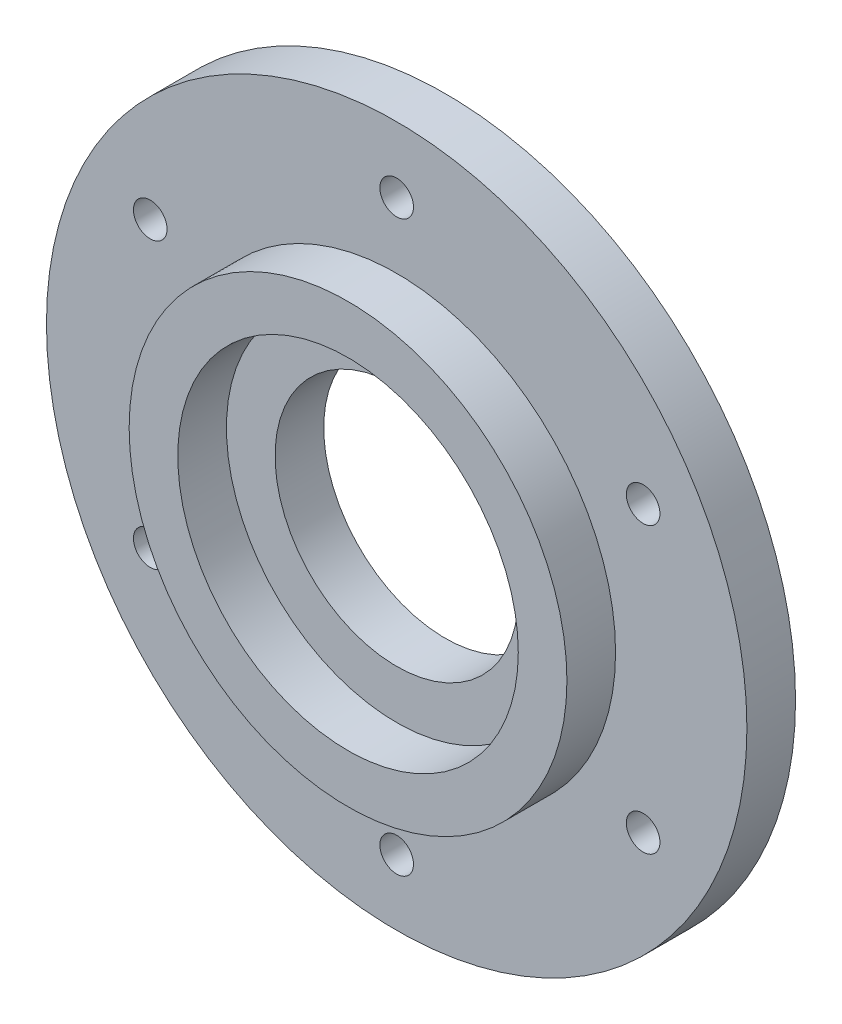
from build123d import *

# Parameters (mm, degrees)
SKETCH_SPINDLE_SKELETON_W                           = 4
SKETCH_SPINDLE_SKELETON_H                           = 5
SKETCH_CENTER_CUT_R                                 = 12.5
CUT_CENTER_DEPTH                                    = 52.15662225
CBORE_FOR_5_BINDING_HEAD_MACHINE_SCREW1_D           = 3.4544
CBORE_FOR_5_BINDING_HEAD_MACHINE_SCREW1_CBORE_D     = 7.54126
CBORE_FOR_5_BINDING_HEAD_MACHINE_SCREW1_CBORE_DEPTH = 1.9812
CIRPATTERN1_COUNT                                   = 6


with BuildPart() as part:
    # Sketch Spindle Skeleton → Main Revolve (revolve)
    with BuildSketch(Plane(origin=(0, 0, 0), x_dir=(0, 0, -1), z_dir=(1, 0, 0)), mode=Mode.PRIVATE) as main_revolve_sk:
        Polygon((-24.2, 22.5), (-25.2, 22.5), (-25.2, 17.5), (-24.2, 17.5), (-24.2, 9.5), (-19.2, 9.5), (-19.2, 36), (-24.2, 36), align=None)
        with Locations((-27.2, 20)):
            Rectangle(SKETCH_SPINDLE_SKELETON_W, SKETCH_SPINDLE_SKELETON_H)
    revolve(main_revolve_sk.sketch.rotate(Axis((0, 0, 1000), (0, 0, -1)), 90), axis=Axis((0, 0, 1000), (0, 0, -1)))

    # Sketch Center Cut → Cut Center (cut, through all)
    with BuildSketch(Plane.XY.offset(24.2)):
        Circle(SKETCH_CENTER_CUT_R)
    extrude(amount=-CUT_CENTER_DEPTH, mode=Mode.SUBTRACT)

    # CBORE for _5 Binding Head Machine Screw1 (through all)
    with Locations(Plane(origin=(0, 0, 19.2), x_dir=(-1, 0, 0), z_dir=(0, 0, -1))):
        with Locations((0, 29.25)):
            cbore_for_5_binding_head_machine_screw1 = CounterBoreHole(CBORE_FOR_5_BINDING_HEAD_MACHINE_SCREW1_D / 2, CBORE_FOR_5_BINDING_HEAD_MACHINE_SCREW1_CBORE_D / 2, CBORE_FOR_5_BINDING_HEAD_MACHINE_SCREW1_CBORE_DEPTH)

    # CirPattern1: CBORE for _5 Binding Head Machine Screw1 ×6 about axis
    cirpattern1_axis = Axis((0, 0, 0), (0, 0, 1))
    for i in range(1, CIRPATTERN1_COUNT):
        add(cbore_for_5_binding_head_machine_screw1.rotate(cirpattern1_axis, i * 360 / CIRPATTERN1_COUNT), mode=Mode.SUBTRACT)


solid = part.part
